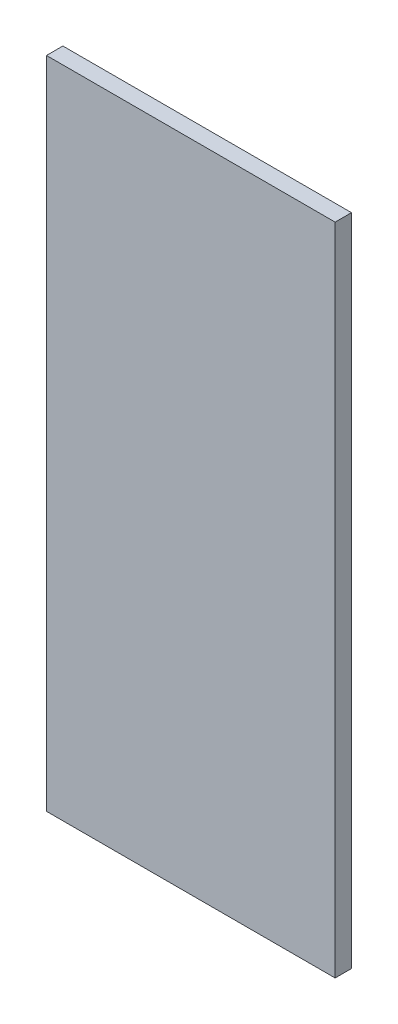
from build123d import *

# Parameters (mm, degrees)
SKETCH1_W           = 112
SKETCH1_H           = 6.35
BOSS_EXTRUDE1_DEPTH = 254


with BuildPart() as part:
    # Sketch1 → Boss-Extrude1 (new body)
    with BuildSketch(Plane(origin=(0, 0, 0), x_dir=(1, 0, 0), z_dir=(0, 1, 0))):
        Rectangle(SKETCH1_W, SKETCH1_H)
    extrude(amount=BOSS_EXTRUDE1_DEPTH)


solid = part.part
